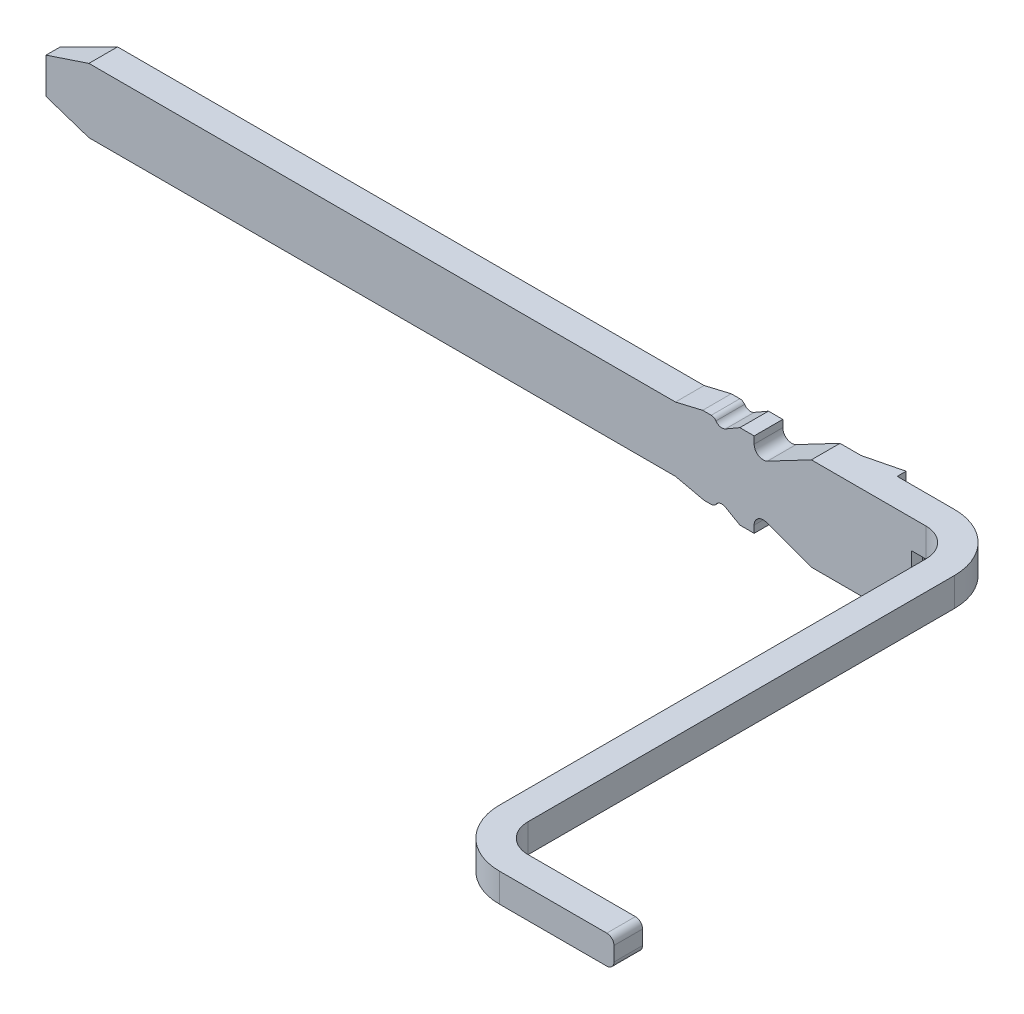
from build123d import *

# Parameters (mm, degrees)
RESSALTO_EXTRUS_O1_DEPTH = 0.2
RESSALTO_EXTRUS_O2_DEPTH = 0.2
CORTE_EXTRUS_O1_DEPTH    = 1
FILETE1_R                = 0.05
RESSALTO_EXTRUS_O3_DEPTH = 0.145
PADR_O_LINEAR1_COUNT     = 2
PADR_O_LINEAR1_PITCH     = 0.505
CORTE_EXTRUS_O2_DEPTH    = 0.3


with BuildPart() as part:
    # Esbo_o1 → Ressalto-extrus_o1 (new body)
    with BuildSketch(Plane.XY):
        with BuildLine():
            Line((76.710328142, 206.616112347), (76.710328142, 206.416112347))
            Line((76.710328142, 206.416112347), (76.657349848, 206.416112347))
            Line((76.657349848, 206.416112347), (76.657349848, 206.116112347))
            Line((76.657349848, 206.116112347), (76.645328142, 206.116112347))
            Line((76.645328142, 206.116112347), (76.610328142, 206.116112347))
            Line((76.610328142, 206.116112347), (76.560328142, 206.116112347))
            ThreePointArc((76.560328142, 206.116112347), (76.524972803, 206.101467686), (76.510328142, 206.066112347))
            Line((76.510328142, 206.066112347), (76.510328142, 205.966112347))
            Line((76.510328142, 205.966112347), (76.110328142, 205.966112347))
            Line((76.110328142, 205.966112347), (76.081970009, 205.966112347))
            Line((76.081970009, 205.966112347), (75.910328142, 205.966112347))
            Line((75.910328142, 205.966112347), (75.595453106, 206.080717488))
            ThreePointArc((75.595453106, 206.080717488), (75.537376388, 206.073071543), (75.510328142, 206.021112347))
            Line((75.510328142, 206.021112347), (75.510328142, 205.971112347))
            Line((75.510328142, 205.971112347), (75.410328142, 205.971112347))
            Line((75.410328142, 205.971112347), (75.309933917, 206.02907498))
            ThreePointArc((75.309933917, 206.02907498), (75.273690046, 206.034493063), (75.243486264, 206.013739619))
            ThreePointArc((75.243486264, 206.013739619), (75.229104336, 206.000793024), (75.210328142, 205.996112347))
            Line((75.210328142, 205.996112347), (75.160328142, 205.996112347))
            Line((75.160328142, 205.996112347), (74.960328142, 206.041112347))
            Line((74.960328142, 206.041112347), (70.860328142, 206.041112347))
            Line((70.860328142, 206.041112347), (70.560328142, 206.141112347))
            Line((70.560328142, 206.141112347), (70.560328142, 206.391112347))
            Line((70.560328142, 206.391112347), (70.860328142, 206.491112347))
            Line((70.860328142, 206.491112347), (74.960328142, 206.491112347))
            Line((74.960328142, 206.491112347), (75.150344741, 206.536112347))
            Line((75.150344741, 206.536112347), (75.210328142, 206.536112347))
            ThreePointArc((75.210328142, 206.536112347), (75.229104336, 206.53143167), (75.243486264, 206.518485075))
            ThreePointArc((75.243486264, 206.518485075), (75.273690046, 206.497731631), (75.309933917, 206.503149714))
            Line((75.309933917, 206.503149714), (75.410328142, 206.561112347))
            Line((75.410328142, 206.561112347), (75.510328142, 206.561112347))
            Line((75.510328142, 206.561112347), (75.510328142, 206.511112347))
            ThreePointArc((75.510328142, 206.511112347), (75.540942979, 206.456830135), (75.60323487, 206.454946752))
            Line((75.60323487, 206.454946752), (75.910328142, 206.616112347))
            Line((75.910328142, 206.616112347), (76.081970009, 206.616112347))
            Line((76.081970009, 206.616112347), (76.110328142, 206.616112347))
            Line((76.110328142, 206.616112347), (76.710328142, 206.616112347))
        make_face()
    extrude(amount=RESSALTO_EXTRUS_O1_DEPTH)

    # Esbo_o2 → Ressalto-extrus_o2 (add)
    with BuildSketch(Plane.XZ.offset(-206.416112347)):
        with BuildLine():
            Line((76.710328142, 0), (76.710328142, 0.2))
            ThreePointArc((76.710328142, 0.2), (76.851749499, 0.258578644), (76.910328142, 0.4))
            Line((76.910328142, 0.4), (76.910328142, 3.38))
            ThreePointArc((76.910328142, 3.38), (77.02748543, 3.662842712), (77.310328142, 3.78))
            Line((77.310328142, 3.78), (78.110328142, 3.78))
            Line((78.110328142, 3.78), (78.110328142, 3.58))
            Line((78.110328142, 3.58), (77.310328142, 3.58))
            ThreePointArc((77.310328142, 3.58), (77.168906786, 3.521421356), (77.110328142, 3.38))
            Line((77.110328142, 3.38), (77.110328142, 0.4))
            ThreePointArc((77.110328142, 0.4), (76.993170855, 0.117157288), (76.710328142, 0))
        make_face()
    extrude(amount=-RESSALTO_EXTRUS_O2_DEPTH)

    # Esbo_o3 → Corte-extrus_o1 (cut)
    with BuildSketch(Plane(origin=(0, 206.491112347, 0), x_dir=(1, 0, 0), z_dir=(0, 1, 0))):
        Polygon((70.860328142, 0), (70.560328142, -0.1), (70.475949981, -0.1), (70.475949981, 0.09851766), (70.860328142, 0.09851766), align=None)
    extrude(amount=-CORTE_EXTRUS_O1_DEPTH, mode=Mode.SUBTRACT)

    # Filete1
    filete1_edges = [part.edges().sort_by_distance(p)[0] for p in [
        (78.110328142, 206.616112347, 3.68),
        (78.110328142, 206.416112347, 3.68),
    ]]
    fillet(filete1_edges, radius=FILETE1_R)

    # Esbo_o4 → Ressalto-extrus_o3 (add)
    with BuildSketch(Plane(origin=(0, 206.616112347, 0), x_dir=(1, 0, 0), z_dir=(0, 1, 0))):
        Polygon((76.057628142, 0), (76.310328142, 0), (76.310328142, 0.0624), align=None)
    ressalto_extrus_o3 = extrude(amount=-RESSALTO_EXTRUS_O3_DEPTH)

    # Padr_o linear1: Ressalto-extrus_o3 ×2
    with Locations(*[(0, -i * PADR_O_LINEAR1_PITCH, 0) for i in range(1, PADR_O_LINEAR1_COUNT)]):
        add(ressalto_extrus_o3)

    # Esbo_o5 → Corte-extrus_o2 (cut)
    with BuildSketch(Plane.XZ.offset(-206.116112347)):
        Polygon((76.657349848, 0.16), (76.645349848, 0.16), (76.608838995, 0.2), (76.608838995, 0.232444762), (76.679680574, 0.232444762), (76.679680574, 0.16), align=None)
        Polygon((76.608838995, 0), (76.645349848, 0.04), (76.679680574, 0.04), (76.679680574, -0.014078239), (76.608838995, -0.014078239), align=None)
    extrude(amount=-CORTE_EXTRUS_O2_DEPTH, mode=Mode.SUBTRACT)


solid = part.part
